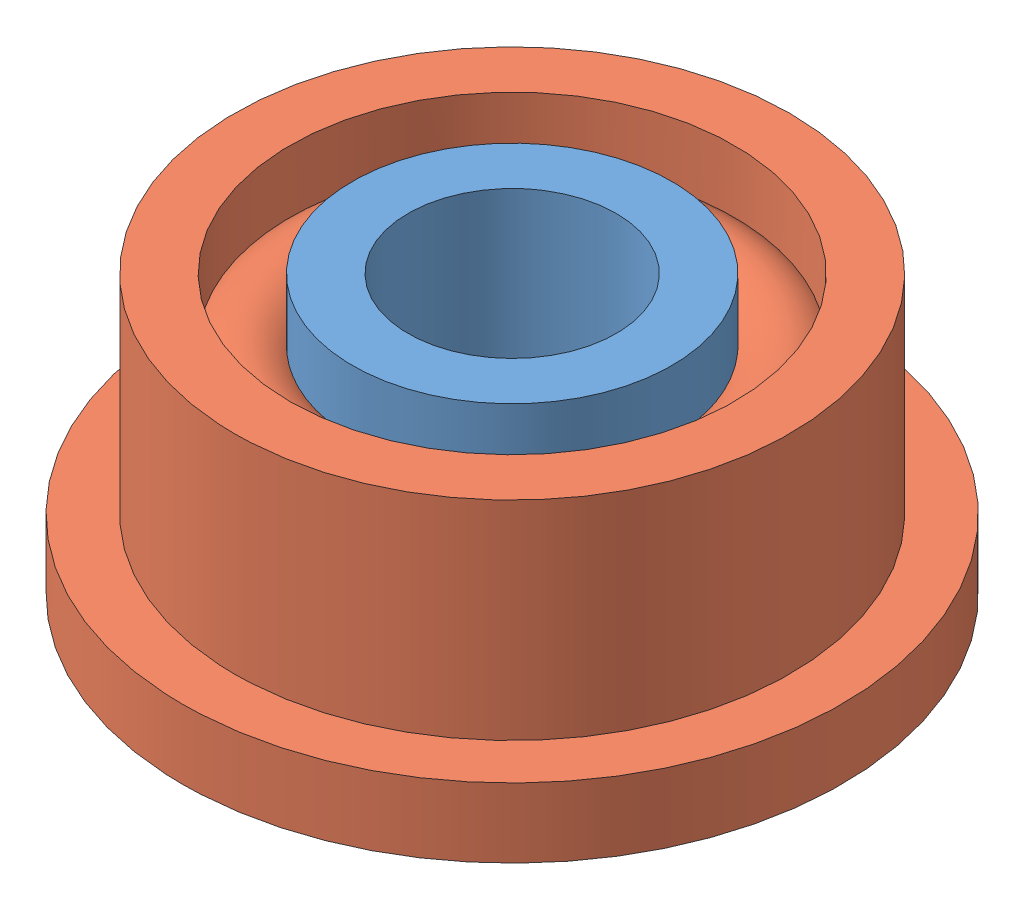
SolidWorks assembly Axial Rotatory part.SLDASM, configuration Default (file format 9000). Lengths in mm.
Overall size (9.5 4 9.5).
2 component instances, 2 part files, 2 mates.
Components (placement in the parent):
- Assisting axis part-1: Assisting axis part.SLDPRT [默认] at (4.0745 3.4937 13.1768) x (-0.804176 0 0.594391) z (-0.594391 0 -0.804176) size (4.6 4 4.6)
- Major Axis-1: Major Axis.SLDPRT [默认] at (4.0745 3.4937 13.1768) size (9.5 4 9.5)
Mates (geometry in assembly coordinates):
- Concentric1: concentric anti-aligned: cylinder of Assisting axis part-1 through (4.0745 7.4937 13.1768) axis (0 -1 0) radius 1.5; cylinder of Major Axis-1 through (4.0745 -2.5063 13.1768) axis (0 1 0) radius 2.3
- Coincident1: coincident aligned: plane of Assisting axis part-1 through (4.0745 3.4937 13.1768) normal (0 -1 0); plane of Major Axis-1 through (4.0745 3.4937 13.1768) normal (0 -1 0)
